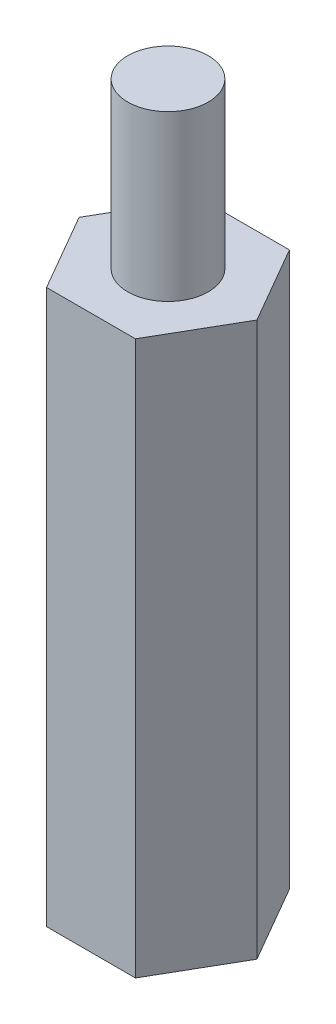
ISO-10303-21;
HEADER;
FILE_DESCRIPTION(('STEP AP214'),'2;1');
FILE_NAME('part.step','',(''),(''),'','','');
FILE_SCHEMA(('AUTOMOTIVE_DESIGN { 1 0 10303 214 1 1 1 1 }'));
ENDSEC;
DATA;
#1=APPLICATION_CONTEXT('core data for automotive mechanical design processes');
#2=APPLICATION_PROTOCOL_DEFINITION('international standard','automotive_design',2000,#1);
#3=PRODUCT_CONTEXT('',#1,'mechanical');
#4=PRODUCT('Part','Part','',(#3));
#5=PRODUCT_RELATED_PRODUCT_CATEGORY('part','',(#4));
#6=PRODUCT_DEFINITION_FORMATION('','',#4);
#7=PRODUCT_DEFINITION_CONTEXT('part definition',#1,'design');
#8=PRODUCT_DEFINITION('design','',#6,#7);
#9=PRODUCT_DEFINITION_SHAPE('','',#8);
#10=(LENGTH_UNIT() NAMED_UNIT(*) SI_UNIT(.MILLI.,.METRE.));
#11=(NAMED_UNIT(*) PLANE_ANGLE_UNIT() SI_UNIT($,.RADIAN.));
#12=(NAMED_UNIT(*) SI_UNIT($,.STERADIAN.) SOLID_ANGLE_UNIT());
#13=UNCERTAINTY_MEASURE_WITH_UNIT(LENGTH_MEASURE(1.E-05),#10,'distance_accuracy_value','');
#14=(GEOMETRIC_REPRESENTATION_CONTEXT(3) GLOBAL_UNCERTAINTY_ASSIGNED_CONTEXT((#13)) GLOBAL_UNIT_ASSIGNED_CONTEXT((#10,
#11,#12)) REPRESENTATION_CONTEXT('',''));
#15=CARTESIAN_POINT('',(0.,0.,0.));
#16=DIRECTION('',(0.,0.,1.));
#17=DIRECTION('',(1.,0.,0.));
#18=AXIS2_PLACEMENT_3D('',#15,#16,#17);
#19=CARTESIAN_POINT('',(1.62778134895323,20.2692,2.8194));
#20=DIRECTION('',(-0.866025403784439,0.,-0.5));
#21=DIRECTION('',(-0.5,0.,0.866025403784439));
#22=AXIS2_PLACEMENT_3D('',#19,#20,#21);
#23=PLANE('',#22);
#24=DIRECTION('',(0.5,0.,-0.866025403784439));
#25=VECTOR('',#24,1.);
#26=CARTESIAN_POINT('',(1.62778134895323,0.,2.8194));
#27=LINE('',#26,#25);
#28=CARTESIAN_POINT('',(1.62778134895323,0.,2.8194));
#29=VERTEX_POINT('',#28);
#30=CARTESIAN_POINT('',(3.25556269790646,0.,0.));
#31=VERTEX_POINT('',#30);
#32=EDGE_CURVE('E118',#29,#31,#27,.T.);
#33=ORIENTED_EDGE('',*,*,#32,.T.);
#34=DIRECTION('',(0.,-1.,0.));
#35=VECTOR('',#34,1.);
#36=CARTESIAN_POINT('',(3.25556269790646,20.2692,0.));
#37=LINE('',#36,#35);
#38=CARTESIAN_POINT('',(3.25556269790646,20.2692,0.));
#39=VERTEX_POINT('',#38);
#40=EDGE_CURVE('E35',#39,#31,#37,.T.);
#41=ORIENTED_EDGE('',*,*,#40,.F.);
#42=DIRECTION('',(0.5,0.,-0.866025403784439));
#43=VECTOR('',#42,1.);
#44=CARTESIAN_POINT('',(1.62778134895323,20.2692,2.8194));
#45=LINE('',#44,#43);
#46=CARTESIAN_POINT('',(1.62778134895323,20.2692,2.8194));
#47=VERTEX_POINT('',#46);
#48=EDGE_CURVE('E129',#47,#39,#45,.T.);
#49=ORIENTED_EDGE('',*,*,#48,.F.);
#50=DIRECTION('',(0.,-1.,0.));
#51=VECTOR('',#50,1.);
#52=CARTESIAN_POINT('',(1.62778134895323,20.2692,2.8194));
#53=LINE('',#52,#51);
#54=EDGE_CURVE('E114',#47,#29,#53,.T.);
#55=ORIENTED_EDGE('',*,*,#54,.T.);
#56=EDGE_LOOP('',(#33,#41,#49,#55));
#57=FACE_BOUND('',#56,.T.);
#58=ADVANCED_FACE('F32',(#57),#23,.F.);
#59=CARTESIAN_POINT('',(3.25556269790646,20.2692,0.));
#60=DIRECTION('',(-0.866025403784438,0.,0.5));
#61=DIRECTION('',(0.5,0.,0.866025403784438));
#62=AXIS2_PLACEMENT_3D('',#59,#60,#61);
#63=PLANE('',#62);
#64=DIRECTION('',(-0.5,0.,-0.866025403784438));
#65=VECTOR('',#64,1.);
#66=CARTESIAN_POINT('',(3.25556269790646,0.,0.));
#67=LINE('',#66,#65);
#68=CARTESIAN_POINT('',(1.62778134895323,0.,-2.8194));
#69=VERTEX_POINT('',#68);
#70=EDGE_CURVE('E121',#31,#69,#67,.T.);
#71=ORIENTED_EDGE('',*,*,#70,.T.);
#72=DIRECTION('',(0.,-1.,0.));
#73=VECTOR('',#72,1.);
#74=CARTESIAN_POINT('',(1.62778134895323,20.2692,-2.8194));
#75=LINE('',#74,#73);
#76=CARTESIAN_POINT('',(1.62778134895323,20.2692,-2.8194));
#77=VERTEX_POINT('',#76);
#78=EDGE_CURVE('E132',#77,#69,#75,.T.);
#79=ORIENTED_EDGE('',*,*,#78,.F.);
#80=DIRECTION('',(-0.5,0.,-0.866025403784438));
#81=VECTOR('',#80,1.);
#82=CARTESIAN_POINT('',(3.25556269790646,20.2692,0.));
#83=LINE('',#82,#81);
#84=EDGE_CURVE('E87',#39,#77,#83,.T.);
#85=ORIENTED_EDGE('',*,*,#84,.F.);
#86=ORIENTED_EDGE('',*,*,#40,.T.);
#87=EDGE_LOOP('',(#71,#79,#85,#86));
#88=FACE_BOUND('',#87,.T.);
#89=ADVANCED_FACE('F137',(#88),#63,.F.);
#90=CARTESIAN_POINT('',(1.62778134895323,20.2692,-2.8194));
#91=DIRECTION('',(0.,0.,1.));
#92=DIRECTION('',(1.,0.,0.));
#93=AXIS2_PLACEMENT_3D('',#90,#91,#92);
#94=PLANE('',#93);
#95=DIRECTION('',(-1.,0.,0.));
#96=VECTOR('',#95,1.);
#97=CARTESIAN_POINT('',(1.62778134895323,0.,-2.8194));
#98=LINE('',#97,#96);
#99=CARTESIAN_POINT('',(-1.62778134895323,0.,-2.8194));
#100=VERTEX_POINT('',#99);
#101=EDGE_CURVE('E124',#69,#100,#98,.T.);
#102=ORIENTED_EDGE('',*,*,#101,.T.);
#103=DIRECTION('',(0.,-1.,0.));
#104=VECTOR('',#103,1.);
#105=CARTESIAN_POINT('',(-1.62778134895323,20.2692,-2.8194));
#106=LINE('',#105,#104);
#107=CARTESIAN_POINT('',(-1.62778134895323,20.2692,-2.8194));
#108=VERTEX_POINT('',#107);
#109=EDGE_CURVE('E109',#108,#100,#106,.T.);
#110=ORIENTED_EDGE('',*,*,#109,.F.);
#111=DIRECTION('',(-1.,0.,0.));
#112=VECTOR('',#111,1.);
#113=CARTESIAN_POINT('',(1.62778134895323,20.2692,-2.8194));
#114=LINE('',#113,#112);
#115=EDGE_CURVE('E100',#77,#108,#114,.T.);
#116=ORIENTED_EDGE('',*,*,#115,.F.);
#117=ORIENTED_EDGE('',*,*,#78,.T.);
#118=EDGE_LOOP('',(#102,#110,#116,#117));
#119=FACE_BOUND('',#118,.T.);
#120=ADVANCED_FACE('F143',(#119),#94,.F.);
#121=CARTESIAN_POINT('',(-1.62778134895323,20.2692,-2.8194));
#122=DIRECTION('',(0.866025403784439,0.,0.5));
#123=DIRECTION('',(0.5,0.,-0.866025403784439));
#124=AXIS2_PLACEMENT_3D('',#121,#122,#123);
#125=PLANE('',#124);
#126=DIRECTION('',(-0.5,0.,0.866025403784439));
#127=VECTOR('',#126,1.);
#128=CARTESIAN_POINT('',(-1.62778134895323,0.,-2.8194));
#129=LINE('',#128,#127);
#130=CARTESIAN_POINT('',(-3.25556269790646,0.,0.));
#131=VERTEX_POINT('',#130);
#132=EDGE_CURVE('E108',#100,#131,#129,.T.);
#133=ORIENTED_EDGE('',*,*,#132,.T.);
#134=DIRECTION('',(0.,-1.,0.));
#135=VECTOR('',#134,1.);
#136=CARTESIAN_POINT('',(-3.25556269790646,20.2692,0.));
#137=LINE('',#136,#135);
#138=CARTESIAN_POINT('',(-3.25556269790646,20.2692,0.));
#139=VERTEX_POINT('',#138);
#140=EDGE_CURVE('E105',#139,#131,#137,.T.);
#141=ORIENTED_EDGE('',*,*,#140,.F.);
#142=DIRECTION('',(-0.5,0.,0.866025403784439));
#143=VECTOR('',#142,1.);
#144=CARTESIAN_POINT('',(-1.62778134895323,20.2692,-2.8194));
#145=LINE('',#144,#143);
#146=EDGE_CURVE('E94',#108,#139,#145,.T.);
#147=ORIENTED_EDGE('',*,*,#146,.F.);
#148=ORIENTED_EDGE('',*,*,#109,.T.);
#149=EDGE_LOOP('',(#133,#141,#147,#148));
#150=FACE_BOUND('',#149,.T.);
#151=ADVANCED_FACE('F106',(#150),#125,.F.);
#152=CARTESIAN_POINT('',(-3.25556269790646,20.2692,0.));
#153=DIRECTION('',(0.866025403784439,0.,-0.5));
#154=DIRECTION('',(-0.5,0.,-0.866025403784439));
#155=AXIS2_PLACEMENT_3D('',#152,#153,#154);
#156=PLANE('',#155);
#157=DIRECTION('',(0.5,0.,0.866025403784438));
#158=VECTOR('',#157,1.);
#159=CARTESIAN_POINT('',(-3.25556269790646,0.,0.));
#160=LINE('',#159,#158);
#161=CARTESIAN_POINT('',(-1.62778134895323,0.,2.8194));
#162=VERTEX_POINT('',#161);
#163=EDGE_CURVE('E72',#131,#162,#160,.T.);
#164=ORIENTED_EDGE('',*,*,#163,.T.);
#165=DIRECTION('',(0.,-1.,0.));
#166=VECTOR('',#165,1.);
#167=CARTESIAN_POINT('',(-1.62778134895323,20.2692,2.8194));
#168=LINE('',#167,#166);
#169=CARTESIAN_POINT('',(-1.62778134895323,20.2692,2.8194));
#170=VERTEX_POINT('',#169);
#171=EDGE_CURVE('E110',#170,#162,#168,.T.);
#172=ORIENTED_EDGE('',*,*,#171,.F.);
#173=DIRECTION('',(0.5,0.,0.866025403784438));
#174=VECTOR('',#173,1.);
#175=CARTESIAN_POINT('',(-3.25556269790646,20.2692,0.));
#176=LINE('',#175,#174);
#177=EDGE_CURVE('E98',#139,#170,#176,.T.);
#178=ORIENTED_EDGE('',*,*,#177,.F.);
#179=ORIENTED_EDGE('',*,*,#140,.T.);
#180=EDGE_LOOP('',(#164,#172,#178,#179));
#181=FACE_BOUND('',#180,.T.);
#182=ADVANCED_FACE('F112',(#181),#156,.F.);
#183=CARTESIAN_POINT('',(-1.62778134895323,20.2692,2.8194));
#184=DIRECTION('',(0.,0.,-1.));
#185=DIRECTION('',(-1.,0.,0.));
#186=AXIS2_PLACEMENT_3D('',#183,#184,#185);
#187=PLANE('',#186);
#188=DIRECTION('',(1.,0.,0.));
#189=VECTOR('',#188,1.);
#190=CARTESIAN_POINT('',(-1.62778134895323,0.,2.8194));
#191=LINE('',#190,#189);
#192=EDGE_CURVE('E78',#162,#29,#191,.T.);
#193=ORIENTED_EDGE('',*,*,#192,.T.);
#194=ORIENTED_EDGE('',*,*,#54,.F.);
#195=DIRECTION('',(1.,0.,0.));
#196=VECTOR('',#195,1.);
#197=CARTESIAN_POINT('',(-1.62778134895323,20.2692,2.8194));
#198=LINE('',#197,#196);
#199=EDGE_CURVE('E49',#170,#47,#198,.T.);
#200=ORIENTED_EDGE('',*,*,#199,.F.);
#201=ORIENTED_EDGE('',*,*,#171,.T.);
#202=EDGE_LOOP('',(#193,#194,#200,#201));
#203=FACE_BOUND('',#202,.T.);
#204=ADVANCED_FACE('F174',(#203),#187,.F.);
#205=CARTESIAN_POINT('',(0.,20.2692,0.));
#206=DIRECTION('',(0.,1.,0.));
#207=DIRECTION('',(0.,0.,1.));
#208=AXIS2_PLACEMENT_3D('',#205,#206,#207);
#209=PLANE('',#208);
#210=CARTESIAN_POINT('',(0.,20.2692,0.));
#211=DIRECTION('',(0.,1.,0.));
#212=DIRECTION('',(0.,0.,1.));
#213=AXIS2_PLACEMENT_3D('',#210,#211,#212);
#214=CIRCLE('',#213,1.4732);
#215=CARTESIAN_POINT('',(0.,20.2692,1.4732));
#216=VERTEX_POINT('',#215);
#217=EDGE_CURVE('E11',#216,#216,#214,.T.);
#218=ORIENTED_EDGE('',*,*,#217,.F.);
#219=EDGE_LOOP('',(#218));
#220=FACE_BOUND('',#219,.T.);
#221=ORIENTED_EDGE('',*,*,#48,.T.);
#222=ORIENTED_EDGE('',*,*,#84,.T.);
#223=ORIENTED_EDGE('',*,*,#115,.T.);
#224=ORIENTED_EDGE('',*,*,#146,.T.);
#225=ORIENTED_EDGE('',*,*,#177,.T.);
#226=ORIENTED_EDGE('',*,*,#199,.T.);
#227=EDGE_LOOP('',(#221,#222,#223,#224,#225,#226));
#228=FACE_BOUND('',#227,.T.);
#229=ADVANCED_FACE('F96',(#220,#228),#209,.T.);
#230=CARTESIAN_POINT('',(0.,0.,0.));
#231=DIRECTION('',(0.,1.,0.));
#232=DIRECTION('',(0.,0.,1.));
#233=AXIS2_PLACEMENT_3D('',#230,#231,#232);
#234=PLANE('',#233);
#235=CARTESIAN_POINT('',(0.,0.,0.));
#236=DIRECTION('',(0.,-1.,0.));
#237=DIRECTION('',(0.,0.,-1.));
#238=AXIS2_PLACEMENT_3D('',#235,#236,#237);
#239=CIRCLE('',#238,1.4732);
#240=CARTESIAN_POINT('',(0.,0.,-1.4732));
#241=VERTEX_POINT('',#240);
#242=EDGE_CURVE('E150',#241,#241,#239,.T.);
#243=ORIENTED_EDGE('',*,*,#242,.F.);
#244=EDGE_LOOP('',(#243));
#245=FACE_BOUND('',#244,.T.);
#246=ORIENTED_EDGE('',*,*,#32,.F.);
#247=ORIENTED_EDGE('',*,*,#192,.F.);
#248=ORIENTED_EDGE('',*,*,#163,.F.);
#249=ORIENTED_EDGE('',*,*,#132,.F.);
#250=ORIENTED_EDGE('',*,*,#101,.F.);
#251=ORIENTED_EDGE('',*,*,#70,.F.);
#252=EDGE_LOOP('',(#246,#247,#248,#249,#250,#251));
#253=FACE_BOUND('',#252,.T.);
#254=ADVANCED_FACE('F142',(#245,#253),#234,.F.);
#255=CARTESIAN_POINT('',(0.,26.289,0.));
#256=DIRECTION('',(0.,-1.,0.));
#257=DIRECTION('',(0.,0.,-1.));
#258=AXIS2_PLACEMENT_3D('',#255,#256,#257);
#259=CYLINDRICAL_SURFACE('',#258,1.4732);
#260=CARTESIAN_POINT('',(0.,26.289,0.));
#261=DIRECTION('',(0.,1.,0.));
#262=DIRECTION('',(0.,0.,1.));
#263=AXIS2_PLACEMENT_3D('',#260,#261,#262);
#264=CIRCLE('',#263,1.4732);
#265=CARTESIAN_POINT('',(0.,26.289,1.4732));
#266=VERTEX_POINT('',#265);
#267=EDGE_CURVE('E122',#266,#266,#264,.T.);
#268=ORIENTED_EDGE('',*,*,#267,.F.);
#269=EDGE_LOOP('',(#268));
#270=FACE_BOUND('',#269,.T.);
#271=ORIENTED_EDGE('',*,*,#217,.T.);
#272=EDGE_LOOP('',(#271));
#273=FACE_BOUND('',#272,.T.);
#274=ADVANCED_FACE('F166',(#270,#273),#259,.T.);
#275=CARTESIAN_POINT('',(0.,26.289,0.));
#276=DIRECTION('',(0.,1.,0.));
#277=DIRECTION('',(0.,0.,1.));
#278=AXIS2_PLACEMENT_3D('',#275,#276,#277);
#279=PLANE('',#278);
#280=ORIENTED_EDGE('',*,*,#267,.T.);
#281=EDGE_LOOP('',(#280));
#282=FACE_BOUND('',#281,.T.);
#283=ADVANCED_FACE('F161',(#282),#279,.T.);
#284=CARTESIAN_POINT('',(0.,6.0198,0.));
#285=DIRECTION('',(0.,-1.,0.));
#286=DIRECTION('',(0.,0.,-1.));
#287=AXIS2_PLACEMENT_3D('',#284,#285,#286);
#288=CYLINDRICAL_SURFACE('',#287,1.4732);
#289=CARTESIAN_POINT('',(0.,6.0198,0.));
#290=DIRECTION('',(0.,-1.,0.));
#291=DIRECTION('',(0.,0.,-1.));
#292=AXIS2_PLACEMENT_3D('',#289,#290,#291);
#293=CIRCLE('',#292,1.4732);
#294=CARTESIAN_POINT('',(0.,6.0198,-1.4732));
#295=VERTEX_POINT('',#294);
#296=EDGE_CURVE('E149',#295,#295,#293,.T.);
#297=ORIENTED_EDGE('',*,*,#296,.F.);
#298=EDGE_LOOP('',(#297));
#299=FACE_BOUND('',#298,.T.);
#300=ORIENTED_EDGE('',*,*,#242,.T.);
#301=EDGE_LOOP('',(#300));
#302=FACE_BOUND('',#301,.T.);
#303=ADVANCED_FACE('F158',(#299,#302),#288,.F.);
#304=CARTESIAN_POINT('',(0.,6.0198,0.));
#305=DIRECTION('',(0.,-1.,0.));
#306=DIRECTION('',(0.,0.,-1.));
#307=AXIS2_PLACEMENT_3D('',#304,#305,#306);
#308=PLANE('',#307);
#309=ORIENTED_EDGE('',*,*,#296,.T.);
#310=EDGE_LOOP('',(#309));
#311=FACE_BOUND('',#310,.T.);
#312=ADVANCED_FACE('F156',(#311),#308,.T.);
#313=CLOSED_SHELL('',(#58,#89,#120,#151,#182,#204,#229,#254,#274,#283,#303,#312));
#314=MANIFOLD_SOLID_BREP('B2',#313);
#315=ADVANCED_BREP_SHAPE_REPRESENTATION('',(#18,#314),#14);
#316=SHAPE_DEFINITION_REPRESENTATION(#9,#315);
ENDSEC;
END-ISO-10303-21;
